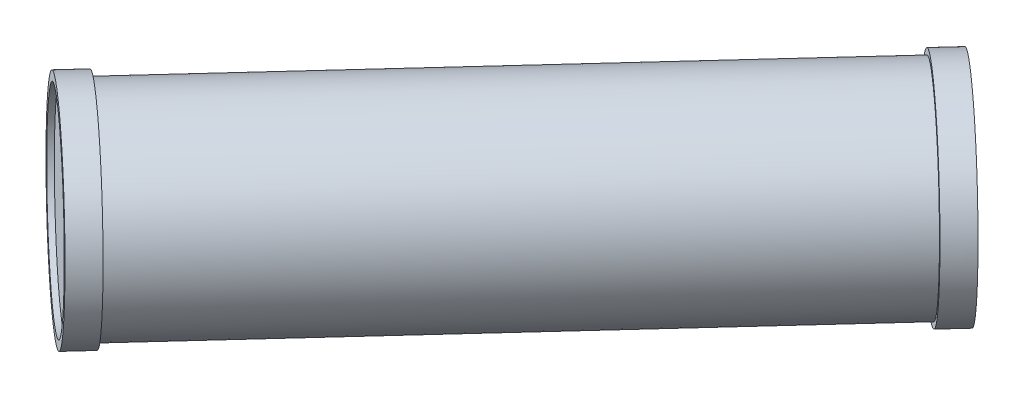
ISO-10303-21;
HEADER;
FILE_DESCRIPTION(('STEP AP214'),'2;1');
FILE_NAME('part.step','',(''),(''),'','','');
FILE_SCHEMA(('AUTOMOTIVE_DESIGN { 1 0 10303 214 1 1 1 1 }'));
ENDSEC;
DATA;
#1=APPLICATION_CONTEXT('core data for automotive mechanical design processes');
#2=APPLICATION_PROTOCOL_DEFINITION('international standard','automotive_design',2000,#1);
#3=PRODUCT_CONTEXT('',#1,'mechanical');
#4=PRODUCT('Part','Part','',(#3));
#5=PRODUCT_RELATED_PRODUCT_CATEGORY('part','',(#4));
#6=PRODUCT_DEFINITION_FORMATION('','',#4);
#7=PRODUCT_DEFINITION_CONTEXT('part definition',#1,'design');
#8=PRODUCT_DEFINITION('design','',#6,#7);
#9=PRODUCT_DEFINITION_SHAPE('','',#8);
#10=(LENGTH_UNIT() NAMED_UNIT(*) SI_UNIT(.MILLI.,.METRE.));
#11=(NAMED_UNIT(*) PLANE_ANGLE_UNIT() SI_UNIT($,.RADIAN.));
#12=(NAMED_UNIT(*) SI_UNIT($,.STERADIAN.) SOLID_ANGLE_UNIT());
#13=UNCERTAINTY_MEASURE_WITH_UNIT(LENGTH_MEASURE(1.E-05),#10,'distance_accuracy_value','');
#14=(GEOMETRIC_REPRESENTATION_CONTEXT(3) GLOBAL_UNCERTAINTY_ASSIGNED_CONTEXT((#13)) GLOBAL_UNIT_ASSIGNED_CONTEXT((#10,
#11,#12)) REPRESENTATION_CONTEXT('',''));
#15=CARTESIAN_POINT('',(0.,0.,0.));
#16=DIRECTION('',(0.,0.,1.));
#17=DIRECTION('',(1.,0.,0.));
#18=AXIS2_PLACEMENT_3D('',#15,#16,#17);
#19=CARTESIAN_POINT('',(-267.34149394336,-92.4073479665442,44.9583211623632));
#20=DIRECTION('',(-0.65911656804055,0.0152958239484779,0.751885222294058));
#21=DIRECTION('',(0.621153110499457,0.574689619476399,0.53282328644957));
#22=AXIS2_PLACEMENT_3D('',#19,#20,#21);
#23=CYLINDRICAL_SURFACE('',#22,17.5);
#24=CARTESIAN_POINT('',(-267.34149394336,-92.4073479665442,44.9583211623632));
#25=DIRECTION('',(0.65911656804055,-0.0152958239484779,-0.751885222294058));
#26=DIRECTION('',(-0.621153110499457,-0.574689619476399,-0.53282328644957));
#27=AXIS2_PLACEMENT_3D('',#24,#25,#26);
#28=CIRCLE('',#27,17.5);
#29=CARTESIAN_POINT('',(-256.471314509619,-82.3502796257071,54.2827286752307));
#30=VERTEX_POINT('',#29);
#31=EDGE_CURVE('P0_E10',#30,#30,#28,.T.);
#32=CARTESIAN_POINT('',(-339.84431642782,-90.7248073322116,127.66569561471));
#33=DIRECTION('',(0.65911656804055,-0.0152958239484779,-0.751885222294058));
#34=DIRECTION('',(-0.621153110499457,-0.574689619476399,-0.53282328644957));
#35=AXIS2_PLACEMENT_3D('',#32,#33,#34);
#36=CIRCLE('',#35,17.5);
#37=CARTESIAN_POINT('',(-328.97413699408,-80.6677389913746,136.990103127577));
#38=VERTEX_POINT('',#37);
#39=EDGE_CURVE('P0_E18',#38,#38,#36,.T.);
#40=CARTESIAN_POINT('',(-256.471314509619,-82.3502796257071,54.2827286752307));
#41=CARTESIAN_POINT('',(-257.226552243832,-82.3327531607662,55.144263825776));
#42=CARTESIAN_POINT('',(-257.981789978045,-82.3152266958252,56.0057989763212));
#43=CARTESIAN_POINT('',(-259.492265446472,-82.2801737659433,57.7288692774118));
#44=CARTESIAN_POINT('',(-260.247503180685,-82.2626473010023,58.5904044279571));
#45=CARTESIAN_POINT('',(-261.757978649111,-82.2275943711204,60.3134747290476));
#46=CARTESIAN_POINT('',(-262.513216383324,-82.2100679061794,61.1750098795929));
#47=CARTESIAN_POINT('',(-264.02369185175,-82.1750149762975,62.8980801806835));
#48=CARTESIAN_POINT('',(-264.778929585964,-82.1574885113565,63.7596153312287));
#49=CARTESIAN_POINT('',(-266.28940505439,-82.1224355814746,65.4826856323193));
#50=CARTESIAN_POINT('',(-267.044642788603,-82.1049091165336,66.3442207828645));
#51=CARTESIAN_POINT('',(-268.555118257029,-82.0698561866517,68.0672910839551));
#52=CARTESIAN_POINT('',(-269.310355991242,-82.0523297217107,68.9288262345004));
#53=CARTESIAN_POINT('',(-270.820831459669,-82.0172767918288,70.6518965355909));
#54=CARTESIAN_POINT('',(-271.576069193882,-81.9997503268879,71.5134316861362));
#55=CARTESIAN_POINT('',(-273.086544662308,-81.9646973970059,73.2365019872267));
#56=CARTESIAN_POINT('',(-273.841782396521,-81.947170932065,74.098037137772));
#57=CARTESIAN_POINT('',(-275.352257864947,-81.912118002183,75.8211074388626));
#58=CARTESIAN_POINT('',(-276.10749559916,-81.8945915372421,76.6826425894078));
#59=CARTESIAN_POINT('',(-277.617971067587,-81.8595386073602,78.4057128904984));
#60=CARTESIAN_POINT('',(-278.3732088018,-81.8420121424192,79.2672480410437));
#61=CARTESIAN_POINT('',(-279.883684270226,-81.8069592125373,80.9903183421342));
#62=CARTESIAN_POINT('',(-280.638922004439,-81.7894327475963,81.8518534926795));
#63=CARTESIAN_POINT('',(-282.149397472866,-81.7543798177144,83.57492379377));
#64=CARTESIAN_POINT('',(-282.904635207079,-81.7368533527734,84.4364589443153));
#65=CARTESIAN_POINT('',(-284.415110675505,-81.7018004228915,86.1595292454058));
#66=CARTESIAN_POINT('',(-285.170348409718,-81.6842739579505,87.0210643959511));
#67=CARTESIAN_POINT('',(-286.680823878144,-81.6492210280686,88.7441346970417));
#68=CARTESIAN_POINT('',(-287.436061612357,-81.6316945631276,89.605669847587));
#69=CARTESIAN_POINT('',(-288.946537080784,-81.5966416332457,91.3287401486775));
#70=CARTESIAN_POINT('',(-289.701774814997,-81.5791151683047,92.1902752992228));
#71=CARTESIAN_POINT('',(-291.212250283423,-81.5440622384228,93.9133456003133));
#72=CARTESIAN_POINT('',(-291.967488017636,-81.5265357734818,94.7748807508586));
#73=CARTESIAN_POINT('',(-293.477963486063,-81.4914828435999,96.4979510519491));
#74=CARTESIAN_POINT('',(-294.233201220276,-81.4739563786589,97.3594862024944));
#75=CARTESIAN_POINT('',(-295.743676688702,-81.438903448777,99.082556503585));
#76=CARTESIAN_POINT('',(-296.498914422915,-81.421376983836,99.9440916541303));
#77=CARTESIAN_POINT('',(-298.009389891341,-81.3863240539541,101.667161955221));
#78=CARTESIAN_POINT('',(-298.764627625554,-81.3687975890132,102.528697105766));
#79=CARTESIAN_POINT('',(-300.275103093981,-81.3337446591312,104.251767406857));
#80=CARTESIAN_POINT('',(-301.030340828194,-81.3162181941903,105.113302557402));
#81=CARTESIAN_POINT('',(-302.54081629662,-81.2811652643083,106.836372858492));
#82=CARTESIAN_POINT('',(-303.296054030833,-81.2636387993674,107.697908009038));
#83=CARTESIAN_POINT('',(-304.806529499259,-81.2285858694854,109.420978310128));
#84=CARTESIAN_POINT('',(-305.561767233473,-81.2110594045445,110.282513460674));
#85=CARTESIAN_POINT('',(-307.072242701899,-81.1760064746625,112.005583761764));
#86=CARTESIAN_POINT('',(-307.827480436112,-81.1584800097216,112.867118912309));
#87=CARTESIAN_POINT('',(-309.337955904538,-81.1234270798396,114.5901892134));
#88=CARTESIAN_POINT('',(-310.093193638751,-81.1059006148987,115.451724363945));
#89=CARTESIAN_POINT('',(-311.603669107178,-81.0708476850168,117.174794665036));
#90=CARTESIAN_POINT('',(-312.358906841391,-81.0533212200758,118.036329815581));
#91=CARTESIAN_POINT('',(-313.869382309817,-81.0182682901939,119.759400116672));
#92=CARTESIAN_POINT('',(-314.62462004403,-81.0007418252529,120.620935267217));
#93=CARTESIAN_POINT('',(-316.135095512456,-80.965688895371,122.344005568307));
#94=CARTESIAN_POINT('',(-316.89033324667,-80.94816243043,123.205540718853));
#95=CARTESIAN_POINT('',(-318.400808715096,-80.9131095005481,124.928611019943));
#96=CARTESIAN_POINT('',(-319.156046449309,-80.8955830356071,125.790146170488));
#97=CARTESIAN_POINT('',(-320.666521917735,-80.8605301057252,127.513216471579));
#98=CARTESIAN_POINT('',(-321.421759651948,-80.8430036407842,128.374751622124));
#99=CARTESIAN_POINT('',(-322.932235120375,-80.8079507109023,130.097821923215));
#100=CARTESIAN_POINT('',(-323.687472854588,-80.7904242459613,130.95935707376));
#101=CARTESIAN_POINT('',(-325.197948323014,-80.7553713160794,132.682427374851));
#102=CARTESIAN_POINT('',(-325.953186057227,-80.7378448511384,133.543962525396));
#103=CARTESIAN_POINT('',(-327.463661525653,-80.7027919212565,135.267032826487));
#104=CARTESIAN_POINT('',(-328.218899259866,-80.6852654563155,136.128567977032));
#105=CARTESIAN_POINT('',(-328.97413699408,-80.6677389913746,136.990103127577));
#106=B_SPLINE_CURVE_WITH_KNOTS('',3,(#40,#41,#42,#43,#44,#45,#46,#47,#48,#49,#50,#51,#52,#53,
#54,#55,#56,#57,#58,#59,#60,#61,#62,#63,#64,#65,#66,#67,#68,#69,#70,#71,#72,#73,#74,#75,#76,#77,
#78,#79,#80,#81,#82,#83,#84,#85,#86,#87,#88,#89,#90,#91,#92,#93,#94,#95,#96,#97,#98,#99,#100,
#101,#102,#103,#104,#105),.UNSPECIFIED.,.F.,.F.,(4,2,2,2,2,2,2,2,2,2,2,2,2,2,2,2,2,2,2,2,2,2,2,
2,2,2,2,2,2,2,2,2,4),(0.,3.43750000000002,6.87499999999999,10.3125,13.75,17.1875,20.625,24.0625,
27.5,30.9375,34.375,37.8125,41.25,44.6875,48.125,51.5625,55.,58.4375,61.875,65.3125,68.75,
72.1875,75.625,79.0625,82.5,85.9375,89.375,92.8125,96.25,99.6874999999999,103.125,106.5625,
110.),.UNSPECIFIED.);
#107=EDGE_CURVE('P0_BSEAM15',#30,#38,#106,.T.);
#108=ORIENTED_EDGE('',*,*,#31,.F.);
#109=ORIENTED_EDGE('',*,*,#39,.T.);
#110=ORIENTED_EDGE('',*,*,#107,.T.);
#111=ORIENTED_EDGE('',*,*,#107,.F.);
#112=EDGE_LOOP('',(#108,#110,#109,#111));
#113=FACE_BOUND('',#112,.T.);
#114=ADVANCED_FACE('P0_F15',(#113),#23,.T.);
#115=CARTESIAN_POINT('',(-264.045911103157,-92.4838270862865,41.1988950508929));
#116=DIRECTION('',(-0.65911656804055,0.0152958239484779,0.751885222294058));
#117=DIRECTION('',(0.621153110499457,0.574689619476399,0.53282328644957));
#118=AXIS2_PLACEMENT_3D('',#115,#116,#117);
#119=CYLINDRICAL_SURFACE('',#118,18.5);
#120=CARTESIAN_POINT('',(-264.045911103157,-92.4838270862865,41.1988950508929));
#121=DIRECTION('',(0.65911656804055,-0.0152958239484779,-0.751885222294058));
#122=DIRECTION('',(-0.621153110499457,-0.574689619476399,-0.53282328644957));
#123=AXIS2_PLACEMENT_3D('',#120,#121,#122);
#124=CIRCLE('',#123,18.5);
#125=CARTESIAN_POINT('',(-252.554578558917,-81.8520691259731,51.05612585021));
#126=VERTEX_POINT('',#125);
#127=EDGE_CURVE('P0_E23',#126,#126,#124,.T.);
#128=CARTESIAN_POINT('',(-267.34149394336,-92.4073479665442,44.9583211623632));
#129=DIRECTION('',(0.65911656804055,-0.0152958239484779,-0.751885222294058));
#130=DIRECTION('',(-0.621153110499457,-0.574689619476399,-0.53282328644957));
#131=AXIS2_PLACEMENT_3D('',#128,#129,#130);
#132=CIRCLE('',#131,18.5);
#133=CARTESIAN_POINT('',(-255.85016139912,-81.7755900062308,54.8155519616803));
#134=VERTEX_POINT('',#133);
#135=EDGE_CURVE('P0_E29',#134,#134,#132,.T.);
#136=CARTESIAN_POINT('',(-252.554578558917,-81.8520691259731,51.05612585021));
#137=CARTESIAN_POINT('',(-252.588907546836,-81.8512724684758,51.0952865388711));
#138=CARTESIAN_POINT('',(-252.623236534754,-81.8504758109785,51.1344472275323));
#139=CARTESIAN_POINT('',(-252.691894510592,-81.8488824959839,51.2127686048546));
#140=CARTESIAN_POINT('',(-252.726223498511,-81.8480858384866,51.2519292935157));
#141=CARTESIAN_POINT('',(-252.794881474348,-81.8464925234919,51.330250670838));
#142=CARTESIAN_POINT('',(-252.829210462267,-81.8456958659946,51.3694113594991));
#143=CARTESIAN_POINT('',(-252.897868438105,-81.844102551,51.4477327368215));
#144=CARTESIAN_POINT('',(-252.932197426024,-81.8433058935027,51.4868934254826));
#145=CARTESIAN_POINT('',(-253.000855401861,-81.841712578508,51.5652148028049));
#146=CARTESIAN_POINT('',(-253.03518438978,-81.8409159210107,51.6043754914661));
#147=CARTESIAN_POINT('',(-253.103842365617,-81.8393226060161,51.6826968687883));
#148=CARTESIAN_POINT('',(-253.138171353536,-81.8385259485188,51.7218575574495));
#149=CARTESIAN_POINT('',(-253.206829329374,-81.8369326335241,51.8001789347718));
#150=CARTESIAN_POINT('',(-253.241158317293,-81.8361359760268,51.8393396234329));
#151=CARTESIAN_POINT('',(-253.30981629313,-81.8345426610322,51.9176610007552));
#152=CARTESIAN_POINT('',(-253.344145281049,-81.8337460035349,51.9568216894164));
#153=CARTESIAN_POINT('',(-253.412803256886,-81.8321526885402,52.0351430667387));
#154=CARTESIAN_POINT('',(-253.447132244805,-81.8313560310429,52.0743037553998));
#155=CARTESIAN_POINT('',(-253.515790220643,-81.8297627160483,52.1526251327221));
#156=CARTESIAN_POINT('',(-253.550119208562,-81.828966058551,52.1917858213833));
#157=CARTESIAN_POINT('',(-253.618777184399,-81.8273727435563,52.2701071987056));
#158=CARTESIAN_POINT('',(-253.653106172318,-81.826576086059,52.3092678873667));
#159=CARTESIAN_POINT('',(-253.721764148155,-81.8249827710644,52.387589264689));
#160=CARTESIAN_POINT('',(-253.756093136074,-81.8241861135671,52.4267499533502));
#161=CARTESIAN_POINT('',(-253.824751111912,-81.8225927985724,52.5050713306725));
#162=CARTESIAN_POINT('',(-253.859080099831,-81.8217961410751,52.5442320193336));
#163=CARTESIAN_POINT('',(-253.927738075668,-81.8202028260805,52.6225533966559));
#164=CARTESIAN_POINT('',(-253.962067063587,-81.8194061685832,52.6617140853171));
#165=CARTESIAN_POINT('',(-254.030725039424,-81.8178128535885,52.7400354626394));
#166=CARTESIAN_POINT('',(-254.065054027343,-81.8170161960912,52.7791961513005));
#167=CARTESIAN_POINT('',(-254.133712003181,-81.8154228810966,52.8575175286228));
#168=CARTESIAN_POINT('',(-254.1680409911,-81.8146262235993,52.896678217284));
#169=CARTESIAN_POINT('',(-254.236698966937,-81.8130329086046,52.9749995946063));
#170=CARTESIAN_POINT('',(-254.271027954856,-81.8122362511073,53.0141602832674));
#171=CARTESIAN_POINT('',(-254.339685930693,-81.8106429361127,53.0924816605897));
#172=CARTESIAN_POINT('',(-254.374014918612,-81.8098462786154,53.1316423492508));
#173=CARTESIAN_POINT('',(-254.44267289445,-81.8082529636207,53.2099637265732));
#174=CARTESIAN_POINT('',(-254.477001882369,-81.8074563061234,53.2491244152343));
#175=CARTESIAN_POINT('',(-254.545659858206,-81.8058629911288,53.3274457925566));
#176=CARTESIAN_POINT('',(-254.579988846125,-81.8050663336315,53.3666064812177));
#177=CARTESIAN_POINT('',(-254.648646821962,-81.8034730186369,53.44492785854));
#178=CARTESIAN_POINT('',(-254.682975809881,-81.8026763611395,53.4840885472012));
#179=CARTESIAN_POINT('',(-254.751633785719,-81.8010830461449,53.5624099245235));
#180=CARTESIAN_POINT('',(-254.785962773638,-81.8002863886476,53.6015706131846));
#181=CARTESIAN_POINT('',(-254.854620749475,-81.7986930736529,53.6798919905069));
#182=CARTESIAN_POINT('',(-254.888949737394,-81.7978964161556,53.7190526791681));
#183=CARTESIAN_POINT('',(-254.957607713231,-81.796303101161,53.7973740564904));
#184=CARTESIAN_POINT('',(-254.99193670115,-81.7955064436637,53.8365347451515));
#185=CARTESIAN_POINT('',(-255.060594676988,-81.793913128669,53.9148561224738));
#186=CARTESIAN_POINT('',(-255.094923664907,-81.7931164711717,53.954016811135));
#187=CARTESIAN_POINT('',(-255.163581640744,-81.7915231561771,54.0323381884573));
#188=CARTESIAN_POINT('',(-255.197910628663,-81.7907264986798,54.0714988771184));
#189=CARTESIAN_POINT('',(-255.2665686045,-81.7891331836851,54.1498202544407));
#190=CARTESIAN_POINT('',(-255.300897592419,-81.7883365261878,54.1889809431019));
#191=CARTESIAN_POINT('',(-255.369555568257,-81.7867432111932,54.2673023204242));
#192=CARTESIAN_POINT('',(-255.403884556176,-81.7859465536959,54.3064630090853));
#193=CARTESIAN_POINT('',(-255.472542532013,-81.7843532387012,54.3847843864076));
#194=CARTESIAN_POINT('',(-255.506871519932,-81.7835565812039,54.4239450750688));
#195=CARTESIAN_POINT('',(-255.575529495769,-81.7819632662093,54.5022664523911));
#196=CARTESIAN_POINT('',(-255.609858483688,-81.781166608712,54.5414271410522));
#197=CARTESIAN_POINT('',(-255.678516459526,-81.7795732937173,54.6197485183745));
#198=CARTESIAN_POINT('',(-255.712845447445,-81.77877663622,54.6589092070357));
#199=CARTESIAN_POINT('',(-255.781503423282,-81.7771833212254,54.737230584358));
#200=CARTESIAN_POINT('',(-255.815832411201,-81.7763866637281,54.7763912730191));
#201=CARTESIAN_POINT('',(-255.85016139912,-81.7755900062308,54.8155519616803));
#202=B_SPLINE_CURVE_WITH_KNOTS('',3,(#136,#137,#138,#139,#140,#141,#142,#143,#144,#145,#146,
#147,#148,#149,#150,#151,#152,#153,#154,#155,#156,#157,#158,#159,#160,#161,#162,#163,#164,#165,
#166,#167,#168,#169,#170,#171,#172,#173,#174,#175,#176,#177,#178,#179,#180,#181,#182,#183,#184,
#185,#186,#187,#188,#189,#190,#191,#192,#193,#194,#195,#196,#197,#198,#199,#200,#201),
.UNSPECIFIED.,.F.,.F.,(4,2,2,2,2,2,2,2,2,2,2,2,2,2,2,2,2,2,2,2,2,2,2,2,2,2,2,2,2,2,2,2,4),(0.,
0.156249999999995,0.312499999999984,0.468750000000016,0.625000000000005,0.78125,
0.93749999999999,1.09374999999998,1.25000000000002,1.40625000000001,1.5625,1.71874999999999,
1.87499999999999,2.03125000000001,2.1875,2.34375,2.49999999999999,2.65625000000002,
2.81250000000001,2.96875,3.12499999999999,3.28124999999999,3.43750000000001,3.59375000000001,
3.75,3.90624999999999,4.06249999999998,4.21875000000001,4.37500000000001,4.53125,
4.68749999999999,4.84374999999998,5.00000000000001),.UNSPECIFIED.);
#203=EDGE_CURVE('P0_BSEAM82',#126,#134,#202,.T.);
#204=ORIENTED_EDGE('',*,*,#127,.F.);
#205=ORIENTED_EDGE('',*,*,#135,.T.);
#206=ORIENTED_EDGE('',*,*,#203,.T.);
#207=ORIENTED_EDGE('',*,*,#203,.F.);
#208=EDGE_LOOP('',(#204,#206,#205,#207));
#209=FACE_BOUND('',#208,.T.);
#210=ADVANCED_FACE('P0_F82',(#209),#119,.T.);
#211=CARTESIAN_POINT('',(-264.045911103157,-92.4838270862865,41.1988950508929));
#212=DIRECTION('',(0.65911656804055,-0.0152958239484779,-0.751885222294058));
#213=DIRECTION('',(-0.621153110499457,-0.574689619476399,-0.53282328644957));
#214=AXIS2_PLACEMENT_3D('',#211,#212,#213);
#215=PLANE('',#214);
#216=ORIENTED_EDGE('',*,*,#127,.T.);
#217=EDGE_LOOP('',(#216));
#218=FACE_BOUND('',#217,.T.);
#219=ADVANCED_FACE('P0_F87',(#218),#215,.T.);
#220=CARTESIAN_POINT('',(-267.34149394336,-92.4073479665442,44.9583211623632));
#221=DIRECTION('',(0.65911656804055,-0.0152958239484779,-0.751885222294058));
#222=DIRECTION('',(-0.621153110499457,-0.574689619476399,-0.53282328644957));
#223=AXIS2_PLACEMENT_3D('',#220,#221,#222);
#224=PLANE('',#223);
#225=ORIENTED_EDGE('',*,*,#31,.T.);
#226=EDGE_LOOP('',(#225));
#227=FACE_BOUND('',#226,.T.);
#228=ORIENTED_EDGE('',*,*,#135,.F.);
#229=EDGE_LOOP('',(#228));
#230=FACE_BOUND('',#229,.T.);
#231=ADVANCED_FACE('P0_F70',(#227,#230),#224,.F.);
#232=CARTESIAN_POINT('',(-343.139899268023,-90.6483282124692,131.42512172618));
#233=DIRECTION('',(0.65911656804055,-0.0152958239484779,-0.751885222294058));
#234=DIRECTION('',(-0.621153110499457,-0.574689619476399,-0.53282328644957));
#235=AXIS2_PLACEMENT_3D('',#232,#233,#234);
#236=CYLINDRICAL_SURFACE('',#235,18.5);
#237=CARTESIAN_POINT('',(-343.139899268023,-90.6483282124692,131.42512172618));
#238=DIRECTION('',(-0.65911656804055,0.0152958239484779,0.751885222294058));
#239=DIRECTION('',(0.621153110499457,0.574689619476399,0.53282328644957));
#240=AXIS2_PLACEMENT_3D('',#237,#238,#239);
#241=CIRCLE('',#240,18.5);
#242=CARTESIAN_POINT('',(-354.631231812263,-101.280086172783,121.567890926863));
#243=VERTEX_POINT('',#242);
#244=EDGE_CURVE('P0_E39',#243,#243,#241,.T.);
#245=CARTESIAN_POINT('',(-339.84431642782,-90.7248073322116,127.66569561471));
#246=DIRECTION('',(-0.65911656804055,0.0152958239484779,0.751885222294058));
#247=DIRECTION('',(0.621153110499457,0.574689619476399,0.53282328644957));
#248=AXIS2_PLACEMENT_3D('',#245,#246,#247);
#249=CIRCLE('',#248,18.5);
#250=CARTESIAN_POINT('',(-351.33564897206,-101.356565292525,117.808464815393));
#251=VERTEX_POINT('',#250);
#252=EDGE_CURVE('P0_E35',#251,#251,#249,.T.);
#253=CARTESIAN_POINT('',(-354.631231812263,-101.280086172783,121.567890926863));
#254=CARTESIAN_POINT('',(-354.596902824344,-101.28088283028,121.528730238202));
#255=CARTESIAN_POINT('',(-354.562573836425,-101.281679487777,121.489569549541));
#256=CARTESIAN_POINT('',(-354.493915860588,-101.283272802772,121.411248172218));
#257=CARTESIAN_POINT('',(-354.459586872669,-101.284069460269,121.372087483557));
#258=CARTESIAN_POINT('',(-354.390928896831,-101.285662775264,121.293766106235));
#259=CARTESIAN_POINT('',(-354.356599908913,-101.286459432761,121.254605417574));
#260=CARTESIAN_POINT('',(-354.287941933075,-101.288052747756,121.176284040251));
#261=CARTESIAN_POINT('',(-354.253612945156,-101.288849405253,121.13712335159));
#262=CARTESIAN_POINT('',(-354.184954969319,-101.290442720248,121.058801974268));
#263=CARTESIAN_POINT('',(-354.1506259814,-101.291239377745,121.019641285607));
#264=CARTESIAN_POINT('',(-354.081968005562,-101.29283269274,120.941319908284));
#265=CARTESIAN_POINT('',(-354.047639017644,-101.293629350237,120.902159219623));
#266=CARTESIAN_POINT('',(-353.978981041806,-101.295222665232,120.823837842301));
#267=CARTESIAN_POINT('',(-353.944652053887,-101.296019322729,120.78467715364));
#268=CARTESIAN_POINT('',(-353.87599407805,-101.297612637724,120.706355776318));
#269=CARTESIAN_POINT('',(-353.841665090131,-101.298409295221,120.667195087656));
#270=CARTESIAN_POINT('',(-353.773007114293,-101.300002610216,120.588873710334));
#271=CARTESIAN_POINT('',(-353.738678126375,-101.300799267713,120.549713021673));
#272=CARTESIAN_POINT('',(-353.670020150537,-101.302392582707,120.471391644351));
#273=CARTESIAN_POINT('',(-353.635691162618,-101.303189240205,120.432230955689));
#274=CARTESIAN_POINT('',(-353.567033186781,-101.304782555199,120.353909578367));
#275=CARTESIAN_POINT('',(-353.532704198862,-101.305579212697,120.314748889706));
#276=CARTESIAN_POINT('',(-353.464046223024,-101.307172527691,120.236427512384));
#277=CARTESIAN_POINT('',(-353.429717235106,-101.307969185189,120.197266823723));
#278=CARTESIAN_POINT('',(-353.361059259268,-101.309562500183,120.1189454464));
#279=CARTESIAN_POINT('',(-353.326730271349,-101.310359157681,120.079784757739));
#280=CARTESIAN_POINT('',(-353.258072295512,-101.311952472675,120.001463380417));
#281=CARTESIAN_POINT('',(-353.223743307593,-101.312749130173,119.962302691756));
#282=CARTESIAN_POINT('',(-353.155085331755,-101.314342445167,119.883981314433));
#283=CARTESIAN_POINT('',(-353.120756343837,-101.315139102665,119.844820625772));
#284=CARTESIAN_POINT('',(-353.052098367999,-101.316732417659,119.76649924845));
#285=CARTESIAN_POINT('',(-353.01776938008,-101.317529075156,119.727338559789));
#286=CARTESIAN_POINT('',(-352.949111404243,-101.319122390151,119.649017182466));
#287=CARTESIAN_POINT('',(-352.914782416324,-101.319919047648,119.609856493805));
#288=CARTESIAN_POINT('',(-352.846124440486,-101.321512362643,119.531535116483));
#289=CARTESIAN_POINT('',(-352.811795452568,-101.32230902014,119.492374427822));
#290=CARTESIAN_POINT('',(-352.74313747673,-101.323902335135,119.4140530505));
#291=CARTESIAN_POINT('',(-352.708808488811,-101.324698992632,119.374892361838));
#292=CARTESIAN_POINT('',(-352.640150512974,-101.326292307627,119.296570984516));
#293=CARTESIAN_POINT('',(-352.605821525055,-101.327088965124,119.257410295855));
#294=CARTESIAN_POINT('',(-352.537163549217,-101.328682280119,119.179088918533));
#295=CARTESIAN_POINT('',(-352.502834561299,-101.329478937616,119.139928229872));
#296=CARTESIAN_POINT('',(-352.434176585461,-101.331072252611,119.061606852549));
#297=CARTESIAN_POINT('',(-352.399847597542,-101.331868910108,119.022446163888));
#298=CARTESIAN_POINT('',(-352.331189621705,-101.333462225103,118.944124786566));
#299=CARTESIAN_POINT('',(-352.296860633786,-101.3342588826,118.904964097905));
#300=CARTESIAN_POINT('',(-352.228202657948,-101.335852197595,118.826642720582));
#301=CARTESIAN_POINT('',(-352.19387367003,-101.336648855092,118.787482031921));
#302=CARTESIAN_POINT('',(-352.125215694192,-101.338242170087,118.709160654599));
#303=CARTESIAN_POINT('',(-352.090886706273,-101.339038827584,118.669999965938));
#304=CARTESIAN_POINT('',(-352.022228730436,-101.340632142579,118.591678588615));
#305=CARTESIAN_POINT('',(-351.987899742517,-101.341428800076,118.552517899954));
#306=CARTESIAN_POINT('',(-351.919241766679,-101.343022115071,118.474196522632));
#307=CARTESIAN_POINT('',(-351.884912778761,-101.343818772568,118.435035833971));
#308=CARTESIAN_POINT('',(-351.816254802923,-101.345412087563,118.356714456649));
#309=CARTESIAN_POINT('',(-351.781925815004,-101.34620874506,118.317553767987));
#310=CARTESIAN_POINT('',(-351.713267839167,-101.347802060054,118.239232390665));
#311=CARTESIAN_POINT('',(-351.678938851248,-101.348598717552,118.200071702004));
#312=CARTESIAN_POINT('',(-351.61028087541,-101.350192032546,118.121750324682));
#313=CARTESIAN_POINT('',(-351.575951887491,-101.350988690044,118.082589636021));
#314=CARTESIAN_POINT('',(-351.507293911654,-101.352582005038,118.004268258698));
#315=CARTESIAN_POINT('',(-351.472964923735,-101.353378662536,117.965107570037));
#316=CARTESIAN_POINT('',(-351.404306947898,-101.35497197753,117.886786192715));
#317=CARTESIAN_POINT('',(-351.369977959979,-101.355768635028,117.847625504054));
#318=CARTESIAN_POINT('',(-351.33564897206,-101.356565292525,117.808464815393));
#319=B_SPLINE_CURVE_WITH_KNOTS('',3,(#253,#254,#255,#256,#257,#258,#259,#260,#261,#262,#263,
#264,#265,#266,#267,#268,#269,#270,#271,#272,#273,#274,#275,#276,#277,#278,#279,#280,#281,#282,
#283,#284,#285,#286,#287,#288,#289,#290,#291,#292,#293,#294,#295,#296,#297,#298,#299,#300,#301,
#302,#303,#304,#305,#306,#307,#308,#309,#310,#311,#312,#313,#314,#315,#316,#317,#318),
.UNSPECIFIED.,.F.,.F.,(4,2,2,2,2,2,2,2,2,2,2,2,2,2,2,2,2,2,2,2,2,2,2,2,2,2,2,2,2,2,2,2,4),(0.,
0.15625,0.31249999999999,0.468750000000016,0.625000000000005,0.781250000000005,
0.937499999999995,1.09374999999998,1.25000000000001,1.40625000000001,1.5625,1.71874999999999,
1.87499999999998,2.03125000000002,2.18750000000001,2.34375,2.5,2.65624999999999,
2.81250000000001,2.96875,3.12499999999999,3.28124999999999,3.43750000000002,3.59375000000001,
3.75000000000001,3.90625,4.06249999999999,4.21875000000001,4.375,4.53125,4.68749999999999,
4.84374999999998,5.00000000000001),.UNSPECIFIED.);
#320=EDGE_CURVE('P0_BSEAM64',#243,#251,#319,.T.);
#321=ORIENTED_EDGE('',*,*,#244,.F.);
#322=ORIENTED_EDGE('',*,*,#252,.T.);
#323=ORIENTED_EDGE('',*,*,#320,.T.);
#324=ORIENTED_EDGE('',*,*,#320,.F.);
#325=EDGE_LOOP('',(#321,#323,#322,#324));
#326=FACE_BOUND('',#325,.T.);
#327=ADVANCED_FACE('P0_F64',(#326),#236,.T.);
#328=CARTESIAN_POINT('',(-343.139899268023,-90.6483282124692,131.42512172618));
#329=DIRECTION('',(-0.65911656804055,0.0152958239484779,0.751885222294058));
#330=DIRECTION('',(0.621153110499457,0.574689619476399,0.53282328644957));
#331=AXIS2_PLACEMENT_3D('',#328,#329,#330);
#332=PLANE('',#331);
#333=CARTESIAN_POINT('',(-343.139899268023,-90.6483282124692,131.42512172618));
#334=DIRECTION('',(-0.65911656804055,0.0152958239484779,0.751885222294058));
#335=DIRECTION('',(0.621153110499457,0.574689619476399,0.53282328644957));
#336=AXIS2_PLACEMENT_3D('',#333,#334,#335);
#337=CIRCLE('',#336,17.);
#338=CARTESIAN_POINT('',(-332.580296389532,-80.8786046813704,140.483117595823));
#339=VERTEX_POINT('',#338);
#340=EDGE_CURVE('P0_E44',#339,#339,#337,.T.);
#341=ORIENTED_EDGE('',*,*,#340,.F.);
#342=EDGE_LOOP('',(#341));
#343=FACE_BOUND('',#342,.T.);
#344=ORIENTED_EDGE('',*,*,#244,.T.);
#345=EDGE_LOOP('',(#344));
#346=FACE_BOUND('',#345,.T.);
#347=ADVANCED_FACE('P0_F61',(#343,#346),#332,.T.);
#348=CARTESIAN_POINT('',(-339.84431642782,-90.7248073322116,127.66569561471));
#349=DIRECTION('',(-0.65911656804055,0.0152958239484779,0.751885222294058));
#350=DIRECTION('',(0.621153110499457,0.574689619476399,0.53282328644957));
#351=AXIS2_PLACEMENT_3D('',#348,#349,#350);
#352=PLANE('',#351);
#353=ORIENTED_EDGE('',*,*,#39,.F.);
#354=EDGE_LOOP('',(#353));
#355=FACE_BOUND('',#354,.T.);
#356=ORIENTED_EDGE('',*,*,#252,.F.);
#357=EDGE_LOOP('',(#356));
#358=FACE_BOUND('',#357,.T.);
#359=ADVANCED_FACE('P0_F57',(#355,#358),#352,.F.);
#360=CARTESIAN_POINT('',(-341.821666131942,-90.6789198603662,129.921351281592));
#361=DIRECTION('',(-0.65911656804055,0.0152958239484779,0.751885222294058));
#362=DIRECTION('',(0.621153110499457,0.574689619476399,0.53282328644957));
#363=AXIS2_PLACEMENT_3D('',#360,#361,#362);
#364=CYLINDRICAL_SURFACE('',#363,17.);
#365=CARTESIAN_POINT('',(-341.821666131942,-90.6789198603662,129.921351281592));
#366=DIRECTION('',(-0.65911656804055,0.0152958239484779,0.751885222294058));
#367=DIRECTION('',(0.621153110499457,0.574689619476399,0.53282328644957));
#368=AXIS2_PLACEMENT_3D('',#365,#366,#367);
#369=CIRCLE('',#368,17.);
#370=CARTESIAN_POINT('',(-331.262063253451,-80.9091963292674,138.979347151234));
#371=VERTEX_POINT('',#370);
#372=EDGE_CURVE('P0_E40',#371,#371,#369,.T.);
#373=CARTESIAN_POINT('',(-331.262063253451,-80.9091963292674,138.979347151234));
#374=CARTESIAN_POINT('',(-331.275794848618,-80.9088776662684,138.995011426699));
#375=CARTESIAN_POINT('',(-331.289526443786,-80.9085590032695,139.010675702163));
#376=CARTESIAN_POINT('',(-331.316989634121,-80.9079216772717,139.042004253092));
#377=CARTESIAN_POINT('',(-331.330721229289,-80.9076030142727,139.057668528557));
#378=CARTESIAN_POINT('',(-331.358184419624,-80.9069656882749,139.088997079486));
#379=CARTESIAN_POINT('',(-331.371916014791,-80.906647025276,139.10466135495));
#380=CARTESIAN_POINT('',(-331.399379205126,-80.9060096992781,139.135989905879));
#381=CARTESIAN_POINT('',(-331.413110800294,-80.9056910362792,139.151654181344));
#382=CARTESIAN_POINT('',(-331.440573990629,-80.9050537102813,139.182982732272));
#383=CARTESIAN_POINT('',(-331.454305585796,-80.9047350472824,139.198647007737));
#384=CARTESIAN_POINT('',(-331.481768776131,-80.9040977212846,139.229975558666));
#385=CARTESIAN_POINT('',(-331.495500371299,-80.9037790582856,139.24563983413));
#386=CARTESIAN_POINT('',(-331.522963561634,-80.9031417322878,139.276968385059));
#387=CARTESIAN_POINT('',(-331.536695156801,-80.9028230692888,139.292632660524));
#388=CARTESIAN_POINT('',(-331.564158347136,-80.902185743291,139.323961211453));
#389=CARTESIAN_POINT('',(-331.577889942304,-80.901867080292,139.339625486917));
#390=CARTESIAN_POINT('',(-331.605353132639,-80.9012297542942,139.370954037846));
#391=CARTESIAN_POINT('',(-331.619084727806,-80.9009110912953,139.38661831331));
#392=CARTESIAN_POINT('',(-331.646547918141,-80.9002737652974,139.417946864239));
#393=CARTESIAN_POINT('',(-331.660279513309,-80.8999551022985,139.433611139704));
#394=CARTESIAN_POINT('',(-331.687742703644,-80.8993177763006,139.464939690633));
#395=CARTESIAN_POINT('',(-331.701474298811,-80.8989991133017,139.480603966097));
#396=CARTESIAN_POINT('',(-331.728937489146,-80.8983617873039,139.511932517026));
#397=CARTESIAN_POINT('',(-331.742669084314,-80.8980431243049,139.527596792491));
#398=CARTESIAN_POINT('',(-331.770132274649,-80.8974057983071,139.558925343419));
#399=CARTESIAN_POINT('',(-331.783863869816,-80.8970871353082,139.574589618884));
#400=CARTESIAN_POINT('',(-331.811327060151,-80.8964498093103,139.605918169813));
#401=CARTESIAN_POINT('',(-331.825058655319,-80.8961311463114,139.621582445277));
#402=CARTESIAN_POINT('',(-331.852521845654,-80.8954938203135,139.652910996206));
#403=CARTESIAN_POINT('',(-331.866253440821,-80.8951751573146,139.668575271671));
#404=CARTESIAN_POINT('',(-331.893716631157,-80.8945378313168,139.6999038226));
#405=CARTESIAN_POINT('',(-331.907448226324,-80.8942191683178,139.715568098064));
#406=CARTESIAN_POINT('',(-331.934911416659,-80.89358184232,139.746896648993));
#407=CARTESIAN_POINT('',(-331.948643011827,-80.893263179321,139.762560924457));
#408=CARTESIAN_POINT('',(-331.976106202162,-80.8926258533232,139.793889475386));
#409=CARTESIAN_POINT('',(-331.989837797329,-80.8923071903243,139.809553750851));
#410=CARTESIAN_POINT('',(-332.017300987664,-80.8916698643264,139.84088230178));
#411=CARTESIAN_POINT('',(-332.031032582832,-80.8913512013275,139.856546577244));
#412=CARTESIAN_POINT('',(-332.058495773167,-80.8907138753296,139.887875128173));
#413=CARTESIAN_POINT('',(-332.072227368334,-80.8903952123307,139.903539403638));
#414=CARTESIAN_POINT('',(-332.099690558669,-80.8897578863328,139.934867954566));
#415=CARTESIAN_POINT('',(-332.113422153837,-80.8894392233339,139.950532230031));
#416=CARTESIAN_POINT('',(-332.140885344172,-80.8888018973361,139.98186078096));
#417=CARTESIAN_POINT('',(-332.154616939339,-80.8884832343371,139.997525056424));
#418=CARTESIAN_POINT('',(-332.182080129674,-80.8878459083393,140.028853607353));
#419=CARTESIAN_POINT('',(-332.195811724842,-80.8875272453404,140.044517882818));
#420=CARTESIAN_POINT('',(-332.223274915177,-80.8868899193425,140.075846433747));
#421=CARTESIAN_POINT('',(-332.237006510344,-80.8865712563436,140.091510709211));
#422=CARTESIAN_POINT('',(-332.264469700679,-80.8859339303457,140.12283926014));
#423=CARTESIAN_POINT('',(-332.278201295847,-80.8856152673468,140.138503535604));
#424=CARTESIAN_POINT('',(-332.305664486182,-80.884977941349,140.169832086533));
#425=CARTESIAN_POINT('',(-332.319396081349,-80.88465927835,140.185496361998));
#426=CARTESIAN_POINT('',(-332.346859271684,-80.8840219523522,140.216824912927));
#427=CARTESIAN_POINT('',(-332.360590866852,-80.8837032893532,140.232489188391));
#428=CARTESIAN_POINT('',(-332.388054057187,-80.8830659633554,140.26381773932));
#429=CARTESIAN_POINT('',(-332.401785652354,-80.8827473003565,140.279482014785));
#430=CARTESIAN_POINT('',(-332.429248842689,-80.8821099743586,140.310810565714));
#431=CARTESIAN_POINT('',(-332.442980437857,-80.8817913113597,140.326474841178));
#432=CARTESIAN_POINT('',(-332.470443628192,-80.8811539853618,140.357803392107));
#433=CARTESIAN_POINT('',(-332.48417522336,-80.8808353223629,140.373467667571));
#434=CARTESIAN_POINT('',(-332.511638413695,-80.880197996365,140.4047962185));
#435=CARTESIAN_POINT('',(-332.525370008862,-80.8798793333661,140.420460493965));
#436=CARTESIAN_POINT('',(-332.552833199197,-80.8792420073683,140.451789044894));
#437=CARTESIAN_POINT('',(-332.566564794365,-80.8789233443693,140.467453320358));
#438=CARTESIAN_POINT('',(-332.580296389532,-80.8786046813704,140.483117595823));
#439=B_SPLINE_CURVE_WITH_KNOTS('',3,(#373,#374,#375,#376,#377,#378,#379,#380,#381,#382,#383,
#384,#385,#386,#387,#388,#389,#390,#391,#392,#393,#394,#395,#396,#397,#398,#399,#400,#401,#402,
#403,#404,#405,#406,#407,#408,#409,#410,#411,#412,#413,#414,#415,#416,#417,#418,#419,#420,#421,
#422,#423,#424,#425,#426,#427,#428,#429,#430,#431,#432,#433,#434,#435,#436,#437,#438),
.UNSPECIFIED.,.F.,.F.,(4,2,2,2,2,2,2,2,2,2,2,2,2,2,2,2,2,2,2,2,2,2,2,2,2,2,2,2,2,2,2,2,4),(0.,
0.0625000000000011,0.125000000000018,0.187500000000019,0.249999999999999,0.312500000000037,
0.375000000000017,0.437500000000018,0.499999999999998,0.562500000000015,0.625000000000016,
0.687499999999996,0.750000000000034,0.812500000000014,0.875000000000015,0.937499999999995,
1.00000000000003,1.06250000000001,1.12499999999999,1.18750000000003,1.25000000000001,
1.31250000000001,1.37499999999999,1.43750000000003,1.50000000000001,1.56249999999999,
1.62499999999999,1.68750000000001,1.75000000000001,1.81249999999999,1.87500000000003,
1.93750000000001,2.00000000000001),.UNSPECIFIED.);
#440=EDGE_CURVE('P0_BSEAM54',#371,#339,#439,.T.);
#441=ORIENTED_EDGE('',*,*,#372,.F.);
#442=ORIENTED_EDGE('',*,*,#340,.T.);
#443=ORIENTED_EDGE('',*,*,#440,.T.);
#444=ORIENTED_EDGE('',*,*,#440,.F.);
#445=EDGE_LOOP('',(#441,#443,#442,#444));
#446=FACE_BOUND('',#445,.T.);
#447=ADVANCED_FACE('P0_F54',(#446),#364,.F.);
#448=CARTESIAN_POINT('',(-341.821666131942,-90.6789198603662,129.921351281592));
#449=DIRECTION('',(-0.65911656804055,0.0152958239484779,0.751885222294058));
#450=DIRECTION('',(0.621153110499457,0.574689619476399,0.53282328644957));
#451=AXIS2_PLACEMENT_3D('',#448,#449,#450);
#452=PLANE('',#451);
#453=ORIENTED_EDGE('',*,*,#372,.T.);
#454=EDGE_LOOP('',(#453));
#455=FACE_BOUND('',#454,.T.);
#456=ADVANCED_FACE('P0_F52',(#455),#452,.T.);
#457=CLOSED_SHELL('',(#114,#210,#219,#231,#327,#347,#359,#447,#456));
#458=MANIFOLD_SOLID_BREP('P0_B1',#457);
#459=CARTESIAN_POINT('',(-342.480782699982,-90.6636240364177,130.673236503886));
#460=DIRECTION('',(0.65911656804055,-0.0152958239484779,-0.751885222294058));
#461=DIRECTION('',(-0.621153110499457,-0.574689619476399,-0.53282328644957));
#462=AXIS2_PLACEMENT_3D('',#459,#460,#461);
#463=CYLINDRICAL_SURFACE('',#462,17.);
#464=CARTESIAN_POINT('',(-342.480782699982,-90.6636240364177,130.673236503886));
#465=DIRECTION('',(-0.65911656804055,0.0152958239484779,0.751885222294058));
#466=DIRECTION('',(0.621153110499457,0.574689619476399,0.53282328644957));
#467=AXIS2_PLACEMENT_3D('',#464,#465,#466);
#468=CIRCLE('',#467,17.);
#469=CARTESIAN_POINT('',(-353.040385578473,-100.433347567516,121.615240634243));
#470=VERTEX_POINT('',#469);
#471=EDGE_CURVE('P1_E10',#470,#470,#468,.T.);
#472=CARTESIAN_POINT('',(-341.821666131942,-90.6789198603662,129.921351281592));
#473=DIRECTION('',(-0.65911656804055,0.0152958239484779,0.751885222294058));
#474=DIRECTION('',(0.621153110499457,0.574689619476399,0.53282328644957));
#475=AXIS2_PLACEMENT_3D('',#472,#473,#474);
#476=CIRCLE('',#475,17.);
#477=CARTESIAN_POINT('',(-352.381269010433,-100.448643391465,120.863355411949));
#478=VERTEX_POINT('',#477);
#479=EDGE_CURVE('P1_E18',#478,#478,#476,.T.);
#480=CARTESIAN_POINT('',(-353.040385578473,-100.433347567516,121.615240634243));
#481=CARTESIAN_POINT('',(-353.033519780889,-100.433506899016,121.607408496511));
#482=CARTESIAN_POINT('',(-353.026653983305,-100.433666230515,121.599576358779));
#483=CARTESIAN_POINT('',(-353.012922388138,-100.433984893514,121.583912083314));
#484=CARTESIAN_POINT('',(-353.006056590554,-100.434144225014,121.576079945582));
#485=CARTESIAN_POINT('',(-352.992324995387,-100.434462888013,121.560415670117));
#486=CARTESIAN_POINT('',(-352.985459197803,-100.434622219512,121.552583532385));
#487=CARTESIAN_POINT('',(-352.971727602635,-100.434940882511,121.536919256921));
#488=CARTESIAN_POINT('',(-352.964861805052,-100.435100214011,121.529087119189));
#489=CARTESIAN_POINT('',(-352.951130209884,-100.435418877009,121.513422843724));
#490=CARTESIAN_POINT('',(-352.9442644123,-100.435578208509,121.505590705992));
#491=CARTESIAN_POINT('',(-352.930532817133,-100.435896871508,121.489926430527));
#492=CARTESIAN_POINT('',(-352.923667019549,-100.436056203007,121.482094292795));
#493=CARTESIAN_POINT('',(-352.909935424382,-100.436374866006,121.466430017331));
#494=CARTESIAN_POINT('',(-352.903069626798,-100.436534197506,121.458597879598));
#495=CARTESIAN_POINT('',(-352.88933803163,-100.436852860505,121.442933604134));
#496=CARTESIAN_POINT('',(-352.882472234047,-100.437012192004,121.435101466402));
#497=CARTESIAN_POINT('',(-352.868740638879,-100.437330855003,121.419437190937));
#498=CARTESIAN_POINT('',(-352.861874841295,-100.437490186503,121.411605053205));
#499=CARTESIAN_POINT('',(-352.848143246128,-100.437808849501,121.395940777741));
#500=CARTESIAN_POINT('',(-352.841277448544,-100.437968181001,121.388108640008));
#501=CARTESIAN_POINT('',(-352.827545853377,-100.438286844,121.372444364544));
#502=CARTESIAN_POINT('',(-352.820680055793,-100.438446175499,121.364612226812));
#503=CARTESIAN_POINT('',(-352.806948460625,-100.438764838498,121.348947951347));
#504=CARTESIAN_POINT('',(-352.800082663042,-100.438924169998,121.341115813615));
#505=CARTESIAN_POINT('',(-352.786351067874,-100.439242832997,121.325451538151));
#506=CARTESIAN_POINT('',(-352.77948527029,-100.439402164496,121.317619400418));
#507=CARTESIAN_POINT('',(-352.765753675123,-100.439720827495,121.301955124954));
#508=CARTESIAN_POINT('',(-352.758887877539,-100.439880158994,121.294122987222));
#509=CARTESIAN_POINT('',(-352.745156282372,-100.440198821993,121.278458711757));
#510=CARTESIAN_POINT('',(-352.738290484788,-100.440358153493,121.270626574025));
#511=CARTESIAN_POINT('',(-352.72455888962,-100.440676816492,121.254962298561));
#512=CARTESIAN_POINT('',(-352.717693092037,-100.440836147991,121.247130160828));
#513=CARTESIAN_POINT('',(-352.703961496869,-100.44115481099,121.231465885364));
#514=CARTESIAN_POINT('',(-352.697095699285,-100.44131414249,121.223633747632));
#515=CARTESIAN_POINT('',(-352.683364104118,-100.441632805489,121.207969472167));
#516=CARTESIAN_POINT('',(-352.676498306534,-100.441792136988,121.200137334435));
#517=CARTESIAN_POINT('',(-352.662766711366,-100.442110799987,121.18447305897));
#518=CARTESIAN_POINT('',(-352.655900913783,-100.442270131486,121.176640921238));
#519=CARTESIAN_POINT('',(-352.642169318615,-100.442588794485,121.160976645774));
#520=CARTESIAN_POINT('',(-352.635303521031,-100.442748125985,121.153144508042));
#521=CARTESIAN_POINT('',(-352.621571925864,-100.443066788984,121.137480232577));
#522=CARTESIAN_POINT('',(-352.61470612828,-100.443226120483,121.129648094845));
#523=CARTESIAN_POINT('',(-352.600974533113,-100.443544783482,121.11398381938));
#524=CARTESIAN_POINT('',(-352.594108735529,-100.443704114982,121.106151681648));
#525=CARTESIAN_POINT('',(-352.580377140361,-100.444022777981,121.090487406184));
#526=CARTESIAN_POINT('',(-352.573511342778,-100.44418210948,121.082655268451));
#527=CARTESIAN_POINT('',(-352.55977974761,-100.444500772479,121.066990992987));
#528=CARTESIAN_POINT('',(-352.552913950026,-100.444660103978,121.059158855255));
#529=CARTESIAN_POINT('',(-352.539182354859,-100.444978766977,121.04349457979));
#530=CARTESIAN_POINT('',(-352.532316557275,-100.445138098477,121.035662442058));
#531=CARTESIAN_POINT('',(-352.518584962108,-100.445456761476,121.019998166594));
#532=CARTESIAN_POINT('',(-352.511719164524,-100.445616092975,121.012166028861));
#533=CARTESIAN_POINT('',(-352.497987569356,-100.445934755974,120.996501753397));
#534=CARTESIAN_POINT('',(-352.491121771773,-100.446094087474,120.988669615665));
#535=CARTESIAN_POINT('',(-352.477390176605,-100.446412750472,120.9730053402));
#536=CARTESIAN_POINT('',(-352.470524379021,-100.446572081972,120.965173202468));
#537=CARTESIAN_POINT('',(-352.456792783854,-100.446890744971,120.949508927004));
#538=CARTESIAN_POINT('',(-352.44992698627,-100.44705007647,120.941676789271));
#539=CARTESIAN_POINT('',(-352.436195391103,-100.447368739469,120.926012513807));
#540=CARTESIAN_POINT('',(-352.429329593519,-100.447528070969,120.918180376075));
#541=CARTESIAN_POINT('',(-352.415597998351,-100.447846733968,120.90251610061));
#542=CARTESIAN_POINT('',(-352.408732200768,-100.448006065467,120.894683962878));
#543=CARTESIAN_POINT('',(-352.3950006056,-100.448324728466,120.879019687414));
#544=CARTESIAN_POINT('',(-352.388134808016,-100.448484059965,120.871187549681));
#545=CARTESIAN_POINT('',(-352.381269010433,-100.448643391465,120.863355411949));
#546=B_SPLINE_CURVE_WITH_KNOTS('',3,(#480,#481,#482,#483,#484,#485,#486,#487,#488,#489,#490,
#491,#492,#493,#494,#495,#496,#497,#498,#499,#500,#501,#502,#503,#504,#505,#506,#507,#508,#509,
#510,#511,#512,#513,#514,#515,#516,#517,#518,#519,#520,#521,#522,#523,#524,#525,#526,#527,#528,
#529,#530,#531,#532,#533,#534,#535,#536,#537,#538,#539,#540,#541,#542,#543,#544,#545),
.UNSPECIFIED.,.F.,.F.,(4,2,2,2,2,2,2,2,2,2,2,2,2,2,2,2,2,2,2,2,2,2,2,2,2,2,2,2,2,2,2,2,4),(0.,
0.0312500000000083,0.0625000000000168,0.093749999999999,0.125000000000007,0.156249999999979,
0.187499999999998,0.218750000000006,0.249999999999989,0.281249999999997,0.312500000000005,
0.343749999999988,0.374999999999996,0.406250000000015,0.437499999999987,0.468749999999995,
0.499999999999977,0.531249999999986,0.562500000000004,0.593749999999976,0.624999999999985,
0.656250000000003,0.687499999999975,0.718749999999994,0.749999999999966,0.781249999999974,
0.812499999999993,0.843749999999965,0.874999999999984,0.906249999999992,0.937499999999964,
0.968749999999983,0.999999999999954),.UNSPECIFIED.);
#547=EDGE_CURVE('P1_BSEAM15',#470,#478,#546,.T.);
#548=ORIENTED_EDGE('',*,*,#471,.F.);
#549=ORIENTED_EDGE('',*,*,#479,.T.);
#550=ORIENTED_EDGE('',*,*,#547,.T.);
#551=ORIENTED_EDGE('',*,*,#547,.F.);
#552=EDGE_LOOP('',(#548,#550,#549,#551));
#553=FACE_BOUND('',#552,.T.);
#554=ADVANCED_FACE('P1_F15',(#553),#463,.T.);
#555=CARTESIAN_POINT('',(-342.480782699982,-90.6636240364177,130.673236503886));
#556=DIRECTION('',(-0.65911656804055,0.0152958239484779,0.751885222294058));
#557=DIRECTION('',(0.621153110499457,0.574689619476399,0.53282328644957));
#558=AXIS2_PLACEMENT_3D('',#555,#556,#557);
#559=PLANE('',#558);
#560=ORIENTED_EDGE('',*,*,#471,.T.);
#561=EDGE_LOOP('',(#560));
#562=FACE_BOUND('',#561,.T.);
#563=ADVANCED_FACE('P1_F30',(#562),#559,.T.);
#564=CARTESIAN_POINT('',(-341.821666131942,-90.6789198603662,129.921351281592));
#565=DIRECTION('',(-0.65911656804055,0.0152958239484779,0.751885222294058));
#566=DIRECTION('',(0.621153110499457,0.574689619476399,0.53282328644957));
#567=AXIS2_PLACEMENT_3D('',#564,#565,#566);
#568=PLANE('',#567);
#569=ORIENTED_EDGE('',*,*,#479,.F.);
#570=EDGE_LOOP('',(#569));
#571=FACE_BOUND('',#570,.T.);
#572=ADVANCED_FACE('P1_F28',(#571),#568,.F.);
#573=CLOSED_SHELL('',(#554,#563,#572));
#574=MANIFOLD_SOLID_BREP('P1_B1',#573);
#575=ADVANCED_BREP_SHAPE_REPRESENTATION('',(#18,#458,#574),#14);
#576=SHAPE_DEFINITION_REPRESENTATION(#9,#575);
ENDSEC;
END-ISO-10303-21;
